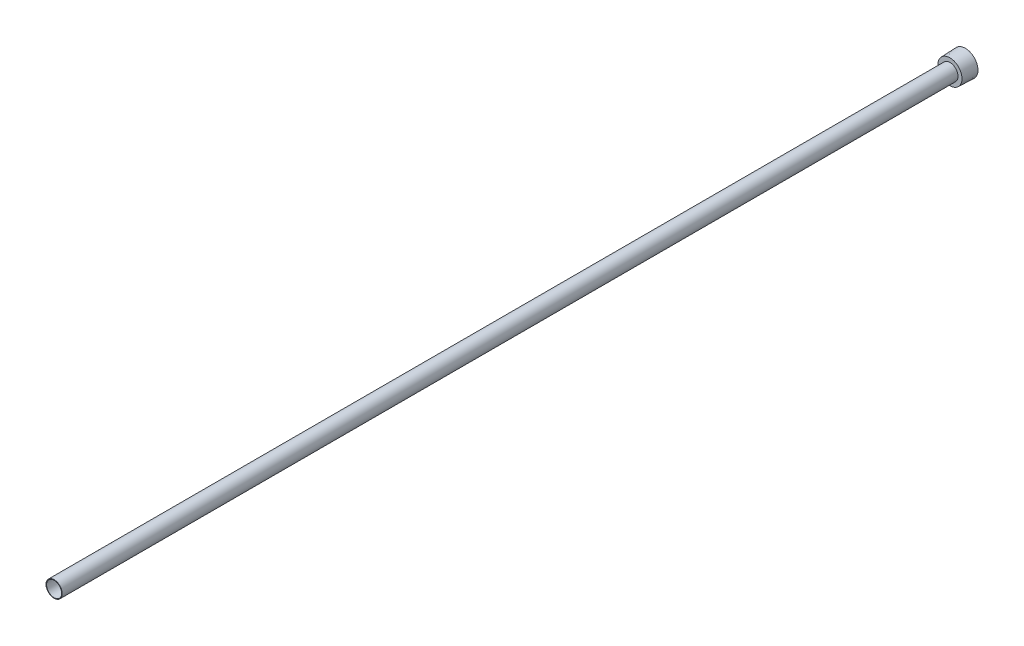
ISO-10303-21;
HEADER;
FILE_DESCRIPTION(('STEP AP214'),'2;1');
FILE_NAME('part.step','',(''),(''),'','','');
FILE_SCHEMA(('AUTOMOTIVE_DESIGN { 1 0 10303 214 1 1 1 1 }'));
ENDSEC;
DATA;
#1=APPLICATION_CONTEXT('core data for automotive mechanical design processes');
#2=APPLICATION_PROTOCOL_DEFINITION('international standard','automotive_design',2000,#1);
#3=PRODUCT_CONTEXT('',#1,'mechanical');
#4=PRODUCT('Part','Part','',(#3));
#5=PRODUCT_RELATED_PRODUCT_CATEGORY('part','',(#4));
#6=PRODUCT_DEFINITION_FORMATION('','',#4);
#7=PRODUCT_DEFINITION_CONTEXT('part definition',#1,'design');
#8=PRODUCT_DEFINITION('design','',#6,#7);
#9=PRODUCT_DEFINITION_SHAPE('','',#8);
#10=(LENGTH_UNIT() NAMED_UNIT(*) SI_UNIT(.MILLI.,.METRE.));
#11=(NAMED_UNIT(*) PLANE_ANGLE_UNIT() SI_UNIT($,.RADIAN.));
#12=(NAMED_UNIT(*) SI_UNIT($,.STERADIAN.) SOLID_ANGLE_UNIT());
#13=UNCERTAINTY_MEASURE_WITH_UNIT(LENGTH_MEASURE(1.E-05),#10,'distance_accuracy_value','');
#14=(GEOMETRIC_REPRESENTATION_CONTEXT(3) GLOBAL_UNCERTAINTY_ASSIGNED_CONTEXT((#13)) GLOBAL_UNIT_ASSIGNED_CONTEXT((#10,
#11,#12)) REPRESENTATION_CONTEXT('',''));
#15=CARTESIAN_POINT('',(0.,0.,0.));
#16=DIRECTION('',(0.,0.,1.));
#17=DIRECTION('',(1.,0.,0.));
#18=AXIS2_PLACEMENT_3D('',#15,#16,#17);
#19=CARTESIAN_POINT('',(0.,0.,0.));
#20=DIRECTION('',(0.,0.,1.));
#21=DIRECTION('',(1.,0.,0.));
#22=AXIS2_PLACEMENT_3D('',#19,#20,#21);
#23=CYLINDRICAL_SURFACE('',#22,5.0419);
#24=CARTESIAN_POINT('',(0.,0.,609.6));
#25=DIRECTION('',(0.,0.,1.));
#26=DIRECTION('',(1.,0.,0.));
#27=AXIS2_PLACEMENT_3D('',#24,#25,#26);
#28=CIRCLE('',#27,5.0419);
#29=CARTESIAN_POINT('',(5.0419,0.,609.6));
#30=VERTEX_POINT('',#29);
#31=EDGE_CURVE('E141',#30,#30,#28,.T.);
#32=CARTESIAN_POINT('',(0.,0.,6.35));
#33=DIRECTION('',(0.,0.,-1.));
#34=DIRECTION('',(-1.,0.,0.));
#35=AXIS2_PLACEMENT_3D('',#32,#33,#34);
#36=CIRCLE('',#35,5.0419);
#37=CARTESIAN_POINT('',(5.0419,0.,6.35));
#38=VERTEX_POINT('',#37);
#39=EDGE_CURVE('E36',#38,#38,#36,.F.);
#40=CARTESIAN_POINT('',(5.0419,0.,609.6));
#41=CARTESIAN_POINT('',(5.0419,0.,603.316145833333));
#42=CARTESIAN_POINT('',(5.0419,0.,597.032291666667));
#43=CARTESIAN_POINT('',(5.0419,0.,584.464583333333));
#44=CARTESIAN_POINT('',(5.0419,0.,578.180729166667));
#45=CARTESIAN_POINT('',(5.0419,0.,565.613020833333));
#46=CARTESIAN_POINT('',(5.0419,0.,559.329166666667));
#47=CARTESIAN_POINT('',(5.0419,0.,546.761458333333));
#48=CARTESIAN_POINT('',(5.0419,0.,540.477604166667));
#49=CARTESIAN_POINT('',(5.0419,0.,527.909895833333));
#50=CARTESIAN_POINT('',(5.0419,0.,521.626041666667));
#51=CARTESIAN_POINT('',(5.0419,0.,509.058333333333));
#52=CARTESIAN_POINT('',(5.0419,0.,502.774479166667));
#53=CARTESIAN_POINT('',(5.0419,0.,490.206770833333));
#54=CARTESIAN_POINT('',(5.0419,0.,483.922916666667));
#55=CARTESIAN_POINT('',(5.0419,0.,471.355208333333));
#56=CARTESIAN_POINT('',(5.0419,0.,465.071354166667));
#57=CARTESIAN_POINT('',(5.0419,0.,452.503645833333));
#58=CARTESIAN_POINT('',(5.0419,0.,446.219791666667));
#59=CARTESIAN_POINT('',(5.0419,0.,433.652083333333));
#60=CARTESIAN_POINT('',(5.0419,0.,427.368229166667));
#61=CARTESIAN_POINT('',(5.0419,0.,414.800520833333));
#62=CARTESIAN_POINT('',(5.0419,0.,408.516666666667));
#63=CARTESIAN_POINT('',(5.0419,0.,395.948958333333));
#64=CARTESIAN_POINT('',(5.0419,0.,389.665104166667));
#65=CARTESIAN_POINT('',(5.0419,0.,377.097395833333));
#66=CARTESIAN_POINT('',(5.0419,0.,370.813541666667));
#67=CARTESIAN_POINT('',(5.0419,0.,358.245833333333));
#68=CARTESIAN_POINT('',(5.0419,0.,351.961979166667));
#69=CARTESIAN_POINT('',(5.0419,0.,339.394270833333));
#70=CARTESIAN_POINT('',(5.0419,0.,333.110416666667));
#71=CARTESIAN_POINT('',(5.0419,0.,320.542708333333));
#72=CARTESIAN_POINT('',(5.0419,0.,314.258854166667));
#73=CARTESIAN_POINT('',(5.0419,0.,301.691145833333));
#74=CARTESIAN_POINT('',(5.0419,0.,295.407291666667));
#75=CARTESIAN_POINT('',(5.0419,0.,282.839583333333));
#76=CARTESIAN_POINT('',(5.0419,0.,276.555729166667));
#77=CARTESIAN_POINT('',(5.0419,0.,263.988020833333));
#78=CARTESIAN_POINT('',(5.0419,0.,257.704166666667));
#79=CARTESIAN_POINT('',(5.0419,0.,245.136458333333));
#80=CARTESIAN_POINT('',(5.0419,0.,238.852604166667));
#81=CARTESIAN_POINT('',(5.0419,0.,226.284895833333));
#82=CARTESIAN_POINT('',(5.0419,0.,220.001041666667));
#83=CARTESIAN_POINT('',(5.0419,0.,207.433333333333));
#84=CARTESIAN_POINT('',(5.0419,0.,201.149479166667));
#85=CARTESIAN_POINT('',(5.0419,0.,188.581770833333));
#86=CARTESIAN_POINT('',(5.0419,0.,182.297916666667));
#87=CARTESIAN_POINT('',(5.0419,0.,169.730208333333));
#88=CARTESIAN_POINT('',(5.0419,0.,163.446354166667));
#89=CARTESIAN_POINT('',(5.0419,0.,150.878645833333));
#90=CARTESIAN_POINT('',(5.0419,0.,144.594791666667));
#91=CARTESIAN_POINT('',(5.0419,0.,132.027083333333));
#92=CARTESIAN_POINT('',(5.0419,0.,125.743229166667));
#93=CARTESIAN_POINT('',(5.0419,0.,113.175520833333));
#94=CARTESIAN_POINT('',(5.0419,0.,106.891666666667));
#95=CARTESIAN_POINT('',(5.0419,0.,94.3239583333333));
#96=CARTESIAN_POINT('',(5.0419,0.,88.0401041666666));
#97=CARTESIAN_POINT('',(5.0419,0.,75.4723958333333));
#98=CARTESIAN_POINT('',(5.0419,0.,69.1885416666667));
#99=CARTESIAN_POINT('',(5.0419,0.,56.6208333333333));
#100=CARTESIAN_POINT('',(5.0419,0.,50.3369791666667));
#101=CARTESIAN_POINT('',(5.0419,0.,37.7692708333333));
#102=CARTESIAN_POINT('',(5.0419,0.,31.4854166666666));
#103=CARTESIAN_POINT('',(5.0419,0.,18.9177083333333));
#104=CARTESIAN_POINT('',(5.0419,0.,12.6338541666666));
#105=CARTESIAN_POINT('',(5.0419,0.,6.34999999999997));
#106=B_SPLINE_CURVE_WITH_KNOTS('',3,(#40,#41,#42,#43,#44,#45,#46,#47,#48,#49,#50,#51,#52,#53,
#54,#55,#56,#57,#58,#59,#60,#61,#62,#63,#64,#65,#66,#67,#68,#69,#70,#71,#72,#73,#74,#75,#76,#77,
#78,#79,#80,#81,#82,#83,#84,#85,#86,#87,#88,#89,#90,#91,#92,#93,#94,#95,#96,#97,#98,#99,#100,
#101,#102,#103,#104,#105),.UNSPECIFIED.,.F.,.F.,(4,2,2,2,2,2,2,2,2,2,2,2,2,2,2,2,2,2,2,2,2,2,2,
2,2,2,2,2,2,2,2,2,4),(0.,18.8515625,37.7031250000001,56.5546875,75.40625,94.2578125,113.109375,
131.9609375,150.8125,169.6640625,188.515625,207.3671875,226.21875,245.0703125,263.921875,
282.7734375,301.625,320.4765625,339.328125,358.1796875,377.03125,395.8828125,414.734375,
433.5859375,452.4375,471.2890625,490.140625,508.9921875,527.84375,546.6953125,565.546875,
584.3984375,603.25),.UNSPECIFIED.);
#107=EDGE_CURVE('BSEAM32',#30,#38,#106,.T.);
#108=ORIENTED_EDGE('',*,*,#31,.T.);
#109=ORIENTED_EDGE('',*,*,#39,.F.);
#110=ORIENTED_EDGE('',*,*,#107,.T.);
#111=ORIENTED_EDGE('',*,*,#107,.F.);
#112=EDGE_LOOP('',(#108,#110,#109,#111));
#113=FACE_BOUND('',#112,.T.);
#114=ADVANCED_FACE('F32',(#113),#23,.F.);
#115=CARTESIAN_POINT('',(0.,0.,0.));
#116=DIRECTION('',(0.,0.,-1.));
#117=DIRECTION('',(-1.,0.,0.));
#118=AXIS2_PLACEMENT_3D('',#115,#116,#117);
#119=CONICAL_SURFACE('',#118,8.4709,0.0364599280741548);
#120=CARTESIAN_POINT('',(0.,0.,10.3124));
#121=DIRECTION('',(0.,0.,1.));
#122=DIRECTION('',(1.,0.,0.));
#123=AXIS2_PLACEMENT_3D('',#120,#121,#122);
#124=CIRCLE('',#123,8.09474394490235);
#125=CARTESIAN_POINT('',(8.09474394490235,0.,10.3124));
#126=VERTEX_POINT('',#125);
#127=EDGE_CURVE('E11',#126,#126,#124,.T.);
#128=ORIENTED_EDGE('',*,*,#127,.F.);
#129=EDGE_LOOP('',(#128));
#130=FACE_BOUND('',#129,.T.);
#131=CARTESIAN_POINT('',(0.,0.,0.));
#132=DIRECTION('',(0.,0.,1.));
#133=DIRECTION('',(1.,0.,0.));
#134=AXIS2_PLACEMENT_3D('',#131,#132,#133);
#135=CIRCLE('',#134,8.4709);
#136=CARTESIAN_POINT('',(8.4709,0.,0.));
#137=VERTEX_POINT('',#136);
#138=EDGE_CURVE('E144',#137,#137,#135,.T.);
#139=ORIENTED_EDGE('',*,*,#138,.T.);
#140=EDGE_LOOP('',(#139));
#141=FACE_BOUND('',#140,.T.);
#142=ADVANCED_FACE('F34',(#130,#141),#119,.T.);
#143=CARTESIAN_POINT('',(0.,8.09474394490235,10.3124));
#144=DIRECTION('',(0.,0.,-1.));
#145=DIRECTION('',(-1.,0.,0.));
#146=AXIS2_PLACEMENT_3D('',#143,#144,#145);
#147=PLANE('',#146);
#148=CARTESIAN_POINT('',(0.,0.,10.3124));
#149=DIRECTION('',(0.,0.,1.));
#150=DIRECTION('',(1.,0.,0.));
#151=AXIS2_PLACEMENT_3D('',#148,#149,#150);
#152=CIRCLE('',#151,5.4229);
#153=CARTESIAN_POINT('',(5.4229,0.,10.3124));
#154=VERTEX_POINT('',#153);
#155=EDGE_CURVE('E41',#154,#154,#152,.T.);
#156=ORIENTED_EDGE('',*,*,#155,.F.);
#157=EDGE_LOOP('',(#156));
#158=FACE_BOUND('',#157,.T.);
#159=ORIENTED_EDGE('',*,*,#127,.T.);
#160=EDGE_LOOP('',(#159));
#161=FACE_BOUND('',#160,.T.);
#162=ADVANCED_FACE('F155',(#158,#161),#147,.F.);
#163=CARTESIAN_POINT('',(0.,0.,168.793426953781));
#164=DIRECTION('',(0.,0.,1.));
#165=DIRECTION('',(1.,0.,0.));
#166=AXIS2_PLACEMENT_3D('',#163,#164,#165);
#167=CYLINDRICAL_SURFACE('',#166,5.42289999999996);
#168=CARTESIAN_POINT('',(0.,0.,609.6));
#169=DIRECTION('',(0.,0.,1.));
#170=DIRECTION('',(1.,0.,0.));
#171=AXIS2_PLACEMENT_3D('',#168,#169,#170);
#172=CIRCLE('',#171,5.42289999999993);
#173=CARTESIAN_POINT('',(5.42289999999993,0.,609.6));
#174=VERTEX_POINT('',#173);
#175=EDGE_CURVE('E147',#174,#174,#172,.T.);
#176=ORIENTED_EDGE('',*,*,#175,.F.);
#177=EDGE_LOOP('',(#176));
#178=FACE_BOUND('',#177,.T.);
#179=ORIENTED_EDGE('',*,*,#155,.T.);
#180=EDGE_LOOP('',(#179));
#181=FACE_BOUND('',#180,.T.);
#182=ADVANCED_FACE('F153',(#178,#181),#167,.T.);
#183=CARTESIAN_POINT('',(0.,5.42289999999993,609.6));
#184=DIRECTION('',(0.,0.,-1.));
#185=DIRECTION('',(-1.,0.,0.));
#186=AXIS2_PLACEMENT_3D('',#183,#184,#185);
#187=PLANE('',#186);
#188=ORIENTED_EDGE('',*,*,#31,.F.);
#189=EDGE_LOOP('',(#188));
#190=FACE_BOUND('',#189,.T.);
#191=ORIENTED_EDGE('',*,*,#175,.T.);
#192=EDGE_LOOP('',(#191));
#193=FACE_BOUND('',#192,.T.);
#194=ADVANCED_FACE('F166',(#190,#193),#187,.F.);
#195=CARTESIAN_POINT('',(0.,0.,0.));
#196=DIRECTION('',(0.,0.,1.));
#197=DIRECTION('',(1.,0.,0.));
#198=AXIS2_PLACEMENT_3D('',#195,#196,#197);
#199=PLANE('',#198);
#200=DIRECTION('',(-0.866025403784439,0.5,0.));
#201=VECTOR('',#200,1.);
#202=CARTESIAN_POINT('',(0.,-6.41580486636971,0.));
#203=LINE('',#202,#201);
#204=CARTESIAN_POINT('',(0.,-6.41580486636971,0.));
#205=VERTEX_POINT('',#204);
#206=CARTESIAN_POINT('',(-5.55625,-3.20790243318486,0.));
#207=VERTEX_POINT('',#206);
#208=EDGE_CURVE('E123',#205,#207,#203,.T.);
#209=ORIENTED_EDGE('',*,*,#208,.F.);
#210=DIRECTION('',(-0.866025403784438,-0.5,0.));
#211=VECTOR('',#210,1.);
#212=CARTESIAN_POINT('',(5.55625,-3.20790243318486,0.));
#213=LINE('',#212,#211);
#214=CARTESIAN_POINT('',(5.55625,-3.20790243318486,0.));
#215=VERTEX_POINT('',#214);
#216=EDGE_CURVE('E48',#215,#205,#213,.T.);
#217=ORIENTED_EDGE('',*,*,#216,.F.);
#218=DIRECTION('',(0.,-1.,0.));
#219=VECTOR('',#218,1.);
#220=CARTESIAN_POINT('',(5.55625,3.20790243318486,0.));
#221=LINE('',#220,#219);
#222=CARTESIAN_POINT('',(5.55625,3.20790243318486,0.));
#223=VERTEX_POINT('',#222);
#224=EDGE_CURVE('E132',#223,#215,#221,.T.);
#225=ORIENTED_EDGE('',*,*,#224,.F.);
#226=DIRECTION('',(0.866025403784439,-0.5,0.));
#227=VECTOR('',#226,1.);
#228=CARTESIAN_POINT('',(0.,6.41580486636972,0.));
#229=LINE('',#228,#227);
#230=CARTESIAN_POINT('',(0.,6.41580486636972,0.));
#231=VERTEX_POINT('',#230);
#232=EDGE_CURVE('E130',#231,#223,#229,.T.);
#233=ORIENTED_EDGE('',*,*,#232,.F.);
#234=DIRECTION('',(0.866025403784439,0.5,0.));
#235=VECTOR('',#234,1.);
#236=CARTESIAN_POINT('',(-5.55625,3.20790243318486,0.));
#237=LINE('',#236,#235);
#238=CARTESIAN_POINT('',(-5.55625,3.20790243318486,0.));
#239=VERTEX_POINT('',#238);
#240=EDGE_CURVE('E96',#239,#231,#237,.T.);
#241=ORIENTED_EDGE('',*,*,#240,.F.);
#242=DIRECTION('',(0.,1.,0.));
#243=VECTOR('',#242,1.);
#244=CARTESIAN_POINT('',(-5.55625,-3.20790243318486,0.));
#245=LINE('',#244,#243);
#246=EDGE_CURVE('E126',#207,#239,#245,.T.);
#247=ORIENTED_EDGE('',*,*,#246,.F.);
#248=EDGE_LOOP('',(#209,#217,#225,#233,#241,#247));
#249=FACE_BOUND('',#248,.T.);
#250=ORIENTED_EDGE('',*,*,#138,.F.);
#251=EDGE_LOOP('',(#250));
#252=FACE_BOUND('',#251,.T.);
#253=ADVANCED_FACE('F164',(#249,#252),#199,.F.);
#254=CARTESIAN_POINT('',(0.,-6.41580486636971,6.35));
#255=DIRECTION('',(0.,0.,-1.));
#256=DIRECTION('',(-1.,0.,0.));
#257=AXIS2_PLACEMENT_3D('',#254,#255,#256);
#258=PLANE('',#257);
#259=DIRECTION('',(-0.866025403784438,-0.5,0.));
#260=VECTOR('',#259,1.);
#261=CARTESIAN_POINT('',(5.55625,-3.20790243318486,6.35));
#262=LINE('',#261,#260);
#263=CARTESIAN_POINT('',(5.55625,-3.20790243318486,6.35));
#264=VERTEX_POINT('',#263);
#265=CARTESIAN_POINT('',(0.,-6.41580486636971,6.35));
#266=VERTEX_POINT('',#265);
#267=EDGE_CURVE('E134',#264,#266,#262,.T.);
#268=ORIENTED_EDGE('',*,*,#267,.T.);
#269=DIRECTION('',(-0.866025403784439,0.5,0.));
#270=VECTOR('',#269,1.);
#271=CARTESIAN_POINT('',(0.,-6.41580486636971,6.35));
#272=LINE('',#271,#270);
#273=CARTESIAN_POINT('',(-5.55625,-3.20790243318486,6.35));
#274=VERTEX_POINT('',#273);
#275=EDGE_CURVE('E117',#266,#274,#272,.T.);
#276=ORIENTED_EDGE('',*,*,#275,.T.);
#277=DIRECTION('',(0.,1.,0.));
#278=VECTOR('',#277,1.);
#279=CARTESIAN_POINT('',(-5.55625,-3.20790243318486,6.35));
#280=LINE('',#279,#278);
#281=CARTESIAN_POINT('',(-5.55625,3.20790243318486,6.35));
#282=VERTEX_POINT('',#281);
#283=EDGE_CURVE('E115',#274,#282,#280,.T.);
#284=ORIENTED_EDGE('',*,*,#283,.T.);
#285=DIRECTION('',(0.866025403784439,0.5,0.));
#286=VECTOR('',#285,1.);
#287=CARTESIAN_POINT('',(-5.55625,3.20790243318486,6.35));
#288=LINE('',#287,#286);
#289=CARTESIAN_POINT('',(0.,6.41580486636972,6.35));
#290=VERTEX_POINT('',#289);
#291=EDGE_CURVE('E93',#282,#290,#288,.T.);
#292=ORIENTED_EDGE('',*,*,#291,.T.);
#293=DIRECTION('',(0.866025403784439,-0.5,0.));
#294=VECTOR('',#293,1.);
#295=CARTESIAN_POINT('',(0.,6.41580486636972,6.35));
#296=LINE('',#295,#294);
#297=CARTESIAN_POINT('',(5.55625,3.20790243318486,6.35));
#298=VERTEX_POINT('',#297);
#299=EDGE_CURVE('E104',#290,#298,#296,.T.);
#300=ORIENTED_EDGE('',*,*,#299,.T.);
#301=DIRECTION('',(0.,-1.,0.));
#302=VECTOR('',#301,1.);
#303=CARTESIAN_POINT('',(5.55625,3.20790243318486,6.35));
#304=LINE('',#303,#302);
#305=EDGE_CURVE('E108',#298,#264,#304,.T.);
#306=ORIENTED_EDGE('',*,*,#305,.T.);
#307=EDGE_LOOP('',(#268,#276,#284,#292,#300,#306));
#308=FACE_BOUND('',#307,.T.);
#309=ORIENTED_EDGE('',*,*,#39,.T.);
#310=EDGE_LOOP('',(#309));
#311=FACE_BOUND('',#310,.T.);
#312=ADVANCED_FACE('F111',(#308,#311),#258,.T.);
#313=CARTESIAN_POINT('',(5.55625,-3.20790243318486,6.35));
#314=DIRECTION('',(0.5,-0.866025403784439,0.));
#315=DIRECTION('',(0.866025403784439,0.5,0.));
#316=AXIS2_PLACEMENT_3D('',#313,#314,#315);
#317=PLANE('',#316);
#318=ORIENTED_EDGE('',*,*,#216,.T.);
#319=DIRECTION('',(0.,0.,-1.));
#320=VECTOR('',#319,1.);
#321=CARTESIAN_POINT('',(0.,-6.41580486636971,6.35));
#322=LINE('',#321,#320);
#323=EDGE_CURVE('E78',#266,#205,#322,.T.);
#324=ORIENTED_EDGE('',*,*,#323,.F.);
#325=ORIENTED_EDGE('',*,*,#267,.F.);
#326=DIRECTION('',(0.,0.,-1.));
#327=VECTOR('',#326,1.);
#328=CARTESIAN_POINT('',(5.55625,-3.20790243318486,6.35));
#329=LINE('',#328,#327);
#330=EDGE_CURVE('E56',#264,#215,#329,.T.);
#331=ORIENTED_EDGE('',*,*,#330,.T.);
#332=EDGE_LOOP('',(#318,#324,#325,#331));
#333=FACE_BOUND('',#332,.T.);
#334=ADVANCED_FACE('F173',(#333),#317,.F.);
#335=CARTESIAN_POINT('',(5.55625,3.20790243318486,6.35));
#336=DIRECTION('',(1.,0.,0.));
#337=DIRECTION('',(0.,0.,-1.));
#338=AXIS2_PLACEMENT_3D('',#335,#336,#337);
#339=PLANE('',#338);
#340=ORIENTED_EDGE('',*,*,#224,.T.);
#341=ORIENTED_EDGE('',*,*,#330,.F.);
#342=ORIENTED_EDGE('',*,*,#305,.F.);
#343=DIRECTION('',(0.,0.,-1.));
#344=VECTOR('',#343,1.);
#345=CARTESIAN_POINT('',(5.55625,3.20790243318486,6.35));
#346=LINE('',#345,#344);
#347=EDGE_CURVE('E100',#298,#223,#346,.T.);
#348=ORIENTED_EDGE('',*,*,#347,.T.);
#349=EDGE_LOOP('',(#340,#341,#342,#348));
#350=FACE_BOUND('',#349,.T.);
#351=ADVANCED_FACE('F187',(#350),#339,.F.);
#352=CARTESIAN_POINT('',(0.,6.41580486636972,6.35));
#353=DIRECTION('',(0.5,0.866025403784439,0.));
#354=DIRECTION('',(-0.866025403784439,0.5,0.));
#355=AXIS2_PLACEMENT_3D('',#352,#353,#354);
#356=PLANE('',#355);
#357=ORIENTED_EDGE('',*,*,#232,.T.);
#358=ORIENTED_EDGE('',*,*,#347,.F.);
#359=ORIENTED_EDGE('',*,*,#299,.F.);
#360=DIRECTION('',(0.,0.,-1.));
#361=VECTOR('',#360,1.);
#362=CARTESIAN_POINT('',(0.,6.41580486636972,6.35));
#363=LINE('',#362,#361);
#364=EDGE_CURVE('E89',#290,#231,#363,.T.);
#365=ORIENTED_EDGE('',*,*,#364,.T.);
#366=EDGE_LOOP('',(#357,#358,#359,#365));
#367=FACE_BOUND('',#366,.T.);
#368=ADVANCED_FACE('F105',(#367),#356,.F.);
#369=CARTESIAN_POINT('',(-5.55625,3.20790243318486,6.35));
#370=DIRECTION('',(-0.5,0.866025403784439,0.));
#371=DIRECTION('',(-0.866025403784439,-0.5,0.));
#372=AXIS2_PLACEMENT_3D('',#369,#370,#371);
#373=PLANE('',#372);
#374=ORIENTED_EDGE('',*,*,#240,.T.);
#375=ORIENTED_EDGE('',*,*,#364,.F.);
#376=ORIENTED_EDGE('',*,*,#291,.F.);
#377=DIRECTION('',(0.,0.,-1.));
#378=VECTOR('',#377,1.);
#379=CARTESIAN_POINT('',(-5.55625,3.20790243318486,6.35));
#380=LINE('',#379,#378);
#381=EDGE_CURVE('E101',#282,#239,#380,.T.);
#382=ORIENTED_EDGE('',*,*,#381,.T.);
#383=EDGE_LOOP('',(#374,#375,#376,#382));
#384=FACE_BOUND('',#383,.T.);
#385=ADVANCED_FACE('F91',(#384),#373,.F.);
#386=CARTESIAN_POINT('',(-5.55625,-3.20790243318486,6.35));
#387=DIRECTION('',(-1.,0.,0.));
#388=DIRECTION('',(0.,0.,1.));
#389=AXIS2_PLACEMENT_3D('',#386,#387,#388);
#390=PLANE('',#389);
#391=ORIENTED_EDGE('',*,*,#246,.T.);
#392=ORIENTED_EDGE('',*,*,#381,.F.);
#393=ORIENTED_EDGE('',*,*,#283,.F.);
#394=DIRECTION('',(0.,0.,-1.));
#395=VECTOR('',#394,1.);
#396=CARTESIAN_POINT('',(-5.55625,-3.20790243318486,6.35));
#397=LINE('',#396,#395);
#398=EDGE_CURVE('E138',#274,#207,#397,.T.);
#399=ORIENTED_EDGE('',*,*,#398,.T.);
#400=EDGE_LOOP('',(#391,#392,#393,#399));
#401=FACE_BOUND('',#400,.T.);
#402=ADVANCED_FACE('F191',(#401),#390,.F.);
#403=CARTESIAN_POINT('',(0.,-6.41580486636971,6.35));
#404=DIRECTION('',(-0.5,-0.866025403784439,0.));
#405=DIRECTION('',(0.866025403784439,-0.5,0.));
#406=AXIS2_PLACEMENT_3D('',#403,#404,#405);
#407=PLANE('',#406);
#408=ORIENTED_EDGE('',*,*,#208,.T.);
#409=ORIENTED_EDGE('',*,*,#398,.F.);
#410=ORIENTED_EDGE('',*,*,#275,.F.);
#411=ORIENTED_EDGE('',*,*,#323,.T.);
#412=EDGE_LOOP('',(#408,#409,#410,#411));
#413=FACE_BOUND('',#412,.T.);
#414=ADVANCED_FACE('F188',(#413),#407,.F.);
#415=CLOSED_SHELL('',(#114,#142,#162,#182,#194,#253,#312,#334,#351,#368,#385,#402,#414));
#416=MANIFOLD_SOLID_BREP('B2',#415);
#417=ADVANCED_BREP_SHAPE_REPRESENTATION('',(#18,#416),#14);
#418=SHAPE_DEFINITION_REPRESENTATION(#9,#417);
ENDSEC;
END-ISO-10303-21;
